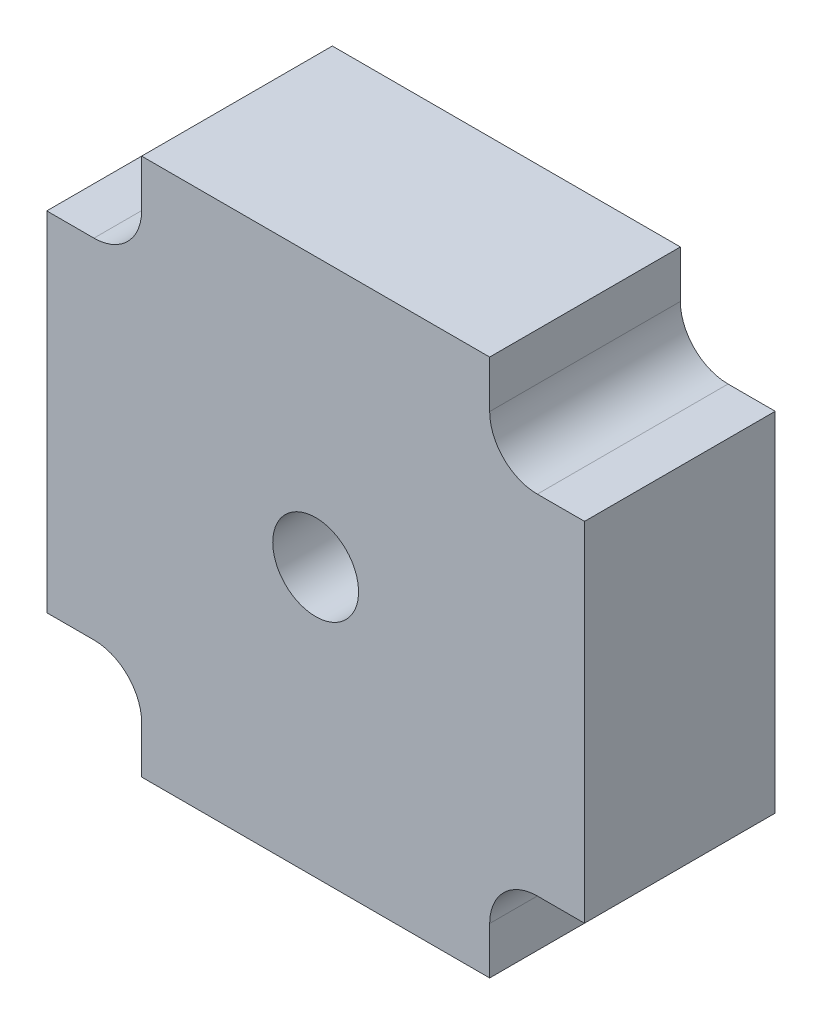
from build123d import *

# Parameters (mm, degrees)
EXTRUDE_1_DEPTH     = 20
SKETCH_2_R          = 4.5
CUT_EXTRUDE_1_DEPTH = 20
FILLET_1_R          = 5


with BuildPart() as part:
    # Sketch 1 → Extrude 1 (new body)
    with BuildSketch(Plane.XY):
        Polygon((-18.25, 18.25), (-28.2, 18.25), (-28.2, -18.25), (-18.25, -18.25), (-18.25, -28.2), (18.25, -28.2), (18.25, -18.25), (28.2, -18.25), (28.2, 18.25), (18.25, 18.25), (18.25, 28.2), (-18.25, 28.2), align=None)
    extrude(amount=EXTRUDE_1_DEPTH)

    # Sketch 2 → Cut-Extrude 1 (cut)
    with BuildSketch(Plane(origin=(0, 0, 0), x_dir=(-1, 0, 0), z_dir=(0, 0, -1))):
        Circle(SKETCH_2_R)
    extrude(amount=-CUT_EXTRUDE_1_DEPTH, mode=Mode.SUBTRACT)

    # Fillet 1
    fillet_1_edges = [part.edges().sort_by_distance(p)[0] for p in [
        (-18.25, 18.25, 10),
        (18.25, 18.25, 10),
        (18.25, -18.25, 10),
        (-18.25, -18.25, 10),
    ]]
    fillet(fillet_1_edges, radius=FILLET_1_R)


solid = part.part
